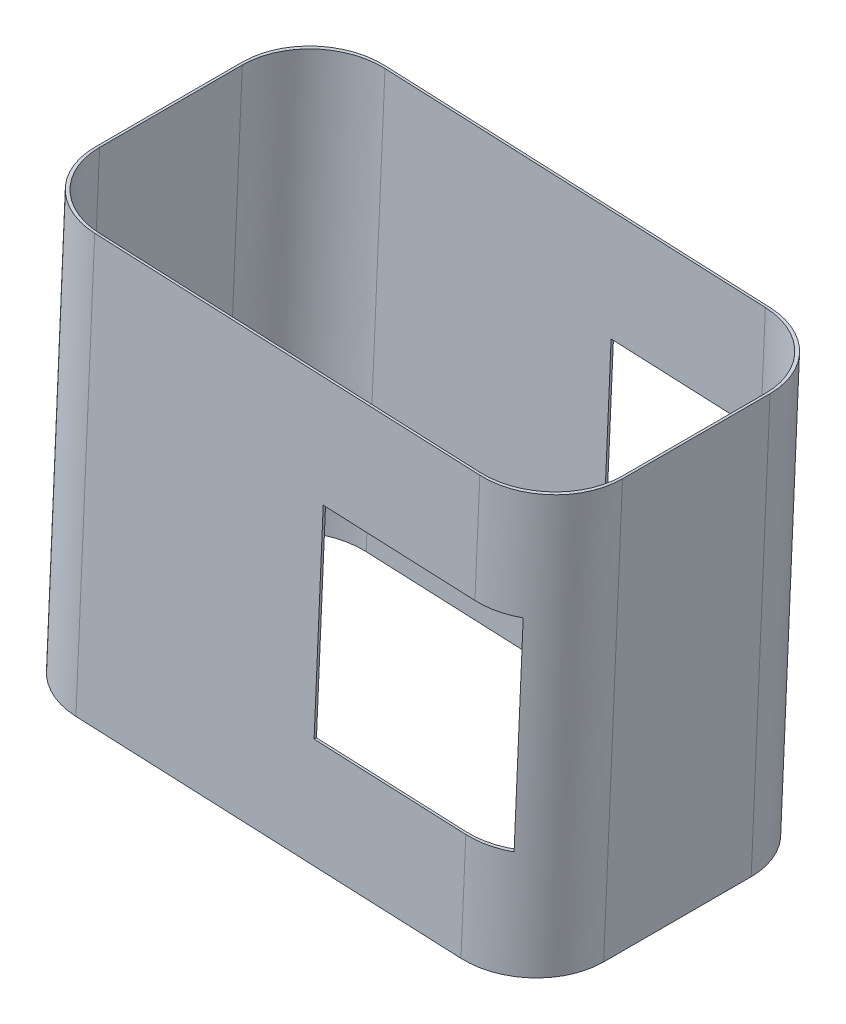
ISO-10303-21;
HEADER;
FILE_DESCRIPTION(('STEP AP214'),'2;1');
FILE_NAME('part.step','',(''),(''),'','','');
FILE_SCHEMA(('AUTOMOTIVE_DESIGN { 1 0 10303 214 1 1 1 1 }'));
ENDSEC;
DATA;
#1=APPLICATION_CONTEXT('core data for automotive mechanical design processes');
#2=APPLICATION_PROTOCOL_DEFINITION('international standard','automotive_design',2000,#1);
#3=PRODUCT_CONTEXT('',#1,'mechanical');
#4=PRODUCT('Part','Part','',(#3));
#5=PRODUCT_RELATED_PRODUCT_CATEGORY('part','',(#4));
#6=PRODUCT_DEFINITION_FORMATION('','',#4);
#7=PRODUCT_DEFINITION_CONTEXT('part definition',#1,'design');
#8=PRODUCT_DEFINITION('design','',#6,#7);
#9=PRODUCT_DEFINITION_SHAPE('','',#8);
#10=(LENGTH_UNIT() NAMED_UNIT(*) SI_UNIT(.MILLI.,.METRE.));
#11=(NAMED_UNIT(*) PLANE_ANGLE_UNIT() SI_UNIT($,.RADIAN.));
#12=(NAMED_UNIT(*) SI_UNIT($,.STERADIAN.) SOLID_ANGLE_UNIT());
#13=UNCERTAINTY_MEASURE_WITH_UNIT(LENGTH_MEASURE(1.E-05),#10,'distance_accuracy_value','');
#14=(GEOMETRIC_REPRESENTATION_CONTEXT(3) GLOBAL_UNCERTAINTY_ASSIGNED_CONTEXT((#13)) GLOBAL_UNIT_ASSIGNED_CONTEXT((#10,
#11,#12)) REPRESENTATION_CONTEXT('',''));
#15=CARTESIAN_POINT('',(0.,0.,0.));
#16=DIRECTION('',(0.,0.,1.));
#17=DIRECTION('',(1.,0.,0.));
#18=AXIS2_PLACEMENT_3D('',#15,#16,#17);
#19=CARTESIAN_POINT('',(-35.4159993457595,1.45818614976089,-39.2));
#20=DIRECTION('',(0.999030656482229,-0.0440198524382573,0.));
#21=DIRECTION('',(0.0440198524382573,0.999030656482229,0.));
#22=AXIS2_PLACEMENT_3D('',#19,#20,#21);
#23=PLANE('',#22);
#24=DIRECTION('',(0.0440198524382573,0.999030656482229,0.));
#25=VECTOR('',#24,1.);
#26=CARTESIAN_POINT('',(-35.223014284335,5.83798258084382,-27.4501272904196));
#27=LINE('',#26,#25);
#28=CARTESIAN_POINT('',(-35.0323227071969,10.1657283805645,-27.4501272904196));
#29=VERTEX_POINT('',#28);
#30=CARTESIAN_POINT('',(-35.4159993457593,1.45818614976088,-27.4501272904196));
#31=VERTEX_POINT('',#30);
#32=EDGE_CURVE('E219',#29,#31,#27,.F.);
#33=ORIENTED_EDGE('',*,*,#32,.F.);
#34=DIRECTION('',(0.,0.,1.));
#35=VECTOR('',#34,1.);
#36=CARTESIAN_POINT('',(-35.032322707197,10.1657283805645,-39.2));
#37=LINE('',#36,#35);
#38=CARTESIAN_POINT('',(-35.0323227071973,10.1657283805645,-27.6148963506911));
#39=VERTEX_POINT('',#38);
#40=EDGE_CURVE('E205',#39,#29,#37,.T.);
#41=ORIENTED_EDGE('',*,*,#40,.F.);
#42=DIRECTION('',(0.0440198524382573,0.999030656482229,0.));
#43=VECTOR('',#42,1.);
#44=CARTESIAN_POINT('',(-35.2230142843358,5.83798258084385,-27.6148963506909));
#45=LINE('',#44,#43);
#46=CARTESIAN_POINT('',(-35.4159993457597,1.45818614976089,-27.6148963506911));
#47=VERTEX_POINT('',#46);
#48=EDGE_CURVE('E230',#39,#47,#45,.F.);
#49=ORIENTED_EDGE('',*,*,#48,.T.);
#50=DIRECTION('',(0.,0.,1.));
#51=VECTOR('',#50,1.);
#52=CARTESIAN_POINT('',(-35.4159993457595,1.45818614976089,-39.2));
#53=LINE('',#52,#51);
#54=EDGE_CURVE('E223',#31,#47,#53,.F.);
#55=ORIENTED_EDGE('',*,*,#54,.F.);
#56=EDGE_LOOP('',(#33,#41,#49,#55));
#57=FACE_BOUND('',#56,.T.);
#58=ADVANCED_FACE('F17',(#57),#23,.F.);
#59=CARTESIAN_POINT('',(-42.9879842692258,10.5162752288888,-39.2));
#60=DIRECTION('',(-0.0440198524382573,-0.999030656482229,0.));
#61=DIRECTION('',(0.999030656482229,-0.0440198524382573,0.));
#62=AXIS2_PLACEMENT_3D('',#59,#60,#61);
#63=PLANE('',#62);
#64=DIRECTION('',(-0.999030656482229,0.0440198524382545,0.));
#65=VECTOR('',#64,1.);
#66=CARTESIAN_POINT('',(-36.6113440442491,10.2353041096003,-27.));
#67=LINE('',#66,#65);
#68=CARTESIAN_POINT('',(-36.6113440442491,10.2353041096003,-27.));
#69=VERTEX_POINT('',#68);
#70=CARTESIAN_POINT('',(-42.9879842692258,10.5162752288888,-27.));
#71=VERTEX_POINT('',#70);
#72=EDGE_CURVE('E199',#69,#71,#67,.T.);
#73=ORIENTED_EDGE('',*,*,#72,.T.);
#74=DIRECTION('',(0.,0.,1.));
#75=VECTOR('',#74,1.);
#76=CARTESIAN_POINT('',(-42.9879842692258,10.5162752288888,-39.2));
#77=LINE('',#76,#75);
#78=CARTESIAN_POINT('',(-42.9879842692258,10.5162752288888,-27.1));
#79=VERTEX_POINT('',#78);
#80=EDGE_CURVE('E214',#71,#79,#77,.F.);
#81=ORIENTED_EDGE('',*,*,#80,.T.);
#82=DIRECTION('',(-0.999030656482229,0.0440198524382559,0.));
#83=VECTOR('',#82,1.);
#84=CARTESIAN_POINT('',(-36.7112471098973,10.2397060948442,-27.1));
#85=LINE('',#84,#83);
#86=CARTESIAN_POINT('',(-36.7112471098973,10.2397060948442,-27.1));
#87=VERTEX_POINT('',#86);
#88=EDGE_CURVE('E353',#87,#79,#85,.T.);
#89=ORIENTED_EDGE('',*,*,#88,.F.);
#90=CARTESIAN_POINT('',(-36.7112471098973,10.2397060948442,-30.1));
#91=DIRECTION('',(0.0440198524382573,0.999030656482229,0.));
#92=DIRECTION('',(-0.999030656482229,0.0440198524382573,0.));
#93=AXIS2_PLACEMENT_3D('',#90,#91,#92);
#94=CIRCLE('',#93,3.);
#95=EDGE_CURVE('E209',#87,#39,#94,.T.);
#96=ORIENTED_EDGE('',*,*,#95,.T.);
#97=ORIENTED_EDGE('',*,*,#40,.T.);
#98=CARTESIAN_POINT('',(-36.6113440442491,10.2353041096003,-30.));
#99=DIRECTION('',(0.0440198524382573,0.999030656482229,0.));
#100=DIRECTION('',(-0.999030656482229,0.0440198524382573,0.));
#101=AXIS2_PLACEMENT_3D('',#98,#99,#100);
#102=CIRCLE('',#101,3.);
#103=EDGE_CURVE('E20',#69,#29,#102,.T.);
#104=ORIENTED_EDGE('',*,*,#103,.F.);
#105=EDGE_LOOP('',(#73,#81,#89,#96,#97,#104));
#106=FACE_BOUND('',#105,.T.);
#107=ADVANCED_FACE('F207',(#106),#63,.T.);
#108=CARTESIAN_POINT('',(-42.9879842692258,10.5162752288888,-39.2));
#109=DIRECTION('',(-0.999030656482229,0.0440198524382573,0.));
#110=DIRECTION('',(-0.0440198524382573,-0.999030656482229,0.));
#111=AXIS2_PLACEMENT_3D('',#108,#109,#110);
#112=PLANE('',#111);
#113=DIRECTION('',(-0.0440198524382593,-0.999030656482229,0.));
#114=VECTOR('',#113,1.);
#115=CARTESIAN_POINT('',(-42.9879842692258,10.5162752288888,-27.));
#116=LINE('',#115,#114);
#117=CARTESIAN_POINT('',(-43.3716609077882,1.80873299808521,-27.));
#118=VERTEX_POINT('',#117);
#119=EDGE_CURVE('E232',#71,#118,#116,.T.);
#120=ORIENTED_EDGE('',*,*,#119,.T.);
#121=DIRECTION('',(0.,0.,1.));
#122=VECTOR('',#121,1.);
#123=CARTESIAN_POINT('',(-43.3716609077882,1.80873299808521,-39.2));
#124=LINE('',#123,#122);
#125=CARTESIAN_POINT('',(-43.3716609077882,1.80873299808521,-27.1));
#126=VERTEX_POINT('',#125);
#127=EDGE_CURVE('E356',#126,#118,#124,.T.);
#128=ORIENTED_EDGE('',*,*,#127,.F.);
#129=DIRECTION('',(-0.0440198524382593,-0.999030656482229,0.));
#130=VECTOR('',#129,1.);
#131=CARTESIAN_POINT('',(-42.9879842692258,10.5162752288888,-27.1));
#132=LINE('',#131,#130);
#133=EDGE_CURVE('E361',#79,#126,#132,.T.);
#134=ORIENTED_EDGE('',*,*,#133,.F.);
#135=ORIENTED_EDGE('',*,*,#80,.F.);
#136=EDGE_LOOP('',(#120,#128,#134,#135));
#137=FACE_BOUND('',#136,.T.);
#138=ADVANCED_FACE('F383',(#137),#112,.F.);
#139=CARTESIAN_POINT('',(-35.4159993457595,1.45818614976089,-39.2));
#140=DIRECTION('',(0.0440198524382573,0.999030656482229,0.));
#141=DIRECTION('',(-0.999030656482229,0.0440198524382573,0.));
#142=AXIS2_PLACEMENT_3D('',#139,#140,#141);
#143=PLANE('',#142);
#144=CARTESIAN_POINT('',(-36.9950206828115,1.52776187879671,-30.));
#145=DIRECTION('',(0.0440198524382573,0.999030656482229,0.));
#146=DIRECTION('',(-0.999030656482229,0.0440198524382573,0.));
#147=AXIS2_PLACEMENT_3D('',#144,#145,#146);
#148=CIRCLE('',#147,3.);
#149=CARTESIAN_POINT('',(-36.9950206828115,1.52776187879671,-27.));
#150=VERTEX_POINT('',#149);
#151=EDGE_CURVE('E225',#31,#150,#148,.F.);
#152=ORIENTED_EDGE('',*,*,#151,.F.);
#153=ORIENTED_EDGE('',*,*,#54,.T.);
#154=CARTESIAN_POINT('',(-37.0949237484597,1.53216386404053,-30.1));
#155=DIRECTION('',(0.0440198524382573,0.999030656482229,0.));
#156=DIRECTION('',(-0.999030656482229,0.0440198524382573,0.));
#157=AXIS2_PLACEMENT_3D('',#154,#155,#156);
#158=CIRCLE('',#157,3.);
#159=CARTESIAN_POINT('',(-37.0949237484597,1.53216386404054,-27.1));
#160=VERTEX_POINT('',#159);
#161=EDGE_CURVE('E318',#47,#160,#158,.F.);
#162=ORIENTED_EDGE('',*,*,#161,.T.);
#163=DIRECTION('',(0.999030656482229,-0.0440198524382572,0.));
#164=VECTOR('',#163,1.);
#165=CARTESIAN_POINT('',(-43.3716609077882,1.80873299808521,-27.1));
#166=LINE('',#165,#164);
#167=EDGE_CURVE('E357',#126,#160,#166,.T.);
#168=ORIENTED_EDGE('',*,*,#167,.F.);
#169=ORIENTED_EDGE('',*,*,#127,.T.);
#170=DIRECTION('',(0.999030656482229,-0.0440198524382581,0.));
#171=VECTOR('',#170,1.);
#172=CARTESIAN_POINT('',(-43.3716609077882,1.80873299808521,-27.));
#173=LINE('',#172,#171);
#174=EDGE_CURVE('E236',#118,#150,#173,.T.);
#175=ORIENTED_EDGE('',*,*,#174,.T.);
#176=EDGE_LOOP('',(#152,#153,#162,#168,#169,#175));
#177=FACE_BOUND('',#176,.T.);
#178=ADVANCED_FACE('F387',(#177),#143,.T.);
#179=CARTESIAN_POINT('',(-55.9834242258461,6.7527394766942,-27.));
#180=DIRECTION('',(0.999030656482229,-0.0440198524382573,0.));
#181=DIRECTION('',(0.0440198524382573,0.999030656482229,0.));
#182=AXIS2_PLACEMENT_3D('',#179,#180,#181);
#183=PLANE('',#182);
#184=DIRECTION('',(0.,0.,1.));
#185=VECTOR('',#184,1.);
#186=CARTESIAN_POINT('',(-56.3796028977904,-2.23853643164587,-33.1));
#187=LINE('',#186,#185);
#188=CARTESIAN_POINT('',(-56.3796028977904,-2.23853643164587,-36.2));
#189=VERTEX_POINT('',#188);
#190=CARTESIAN_POINT('',(-56.3796028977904,-2.23853643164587,-30.));
#191=VERTEX_POINT('',#190);
#192=EDGE_CURVE('E294',#189,#191,#187,.T.);
#193=ORIENTED_EDGE('',*,*,#192,.T.);
#194=DIRECTION('',(0.0440198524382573,0.999030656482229,0.));
#195=VECTOR('',#194,1.);
#196=CARTESIAN_POINT('',(-55.9834242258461,6.7527394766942,-30.));
#197=LINE('',#196,#195);
#198=CARTESIAN_POINT('',(-55.5872455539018,15.7440153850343,-30.));
#199=VERTEX_POINT('',#198);
#200=EDGE_CURVE('E348',#199,#191,#197,.F.);
#201=ORIENTED_EDGE('',*,*,#200,.F.);
#202=DIRECTION('',(0.,0.,1.));
#203=VECTOR('',#202,1.);
#204=CARTESIAN_POINT('',(-55.5872455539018,15.7440153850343,-33.1));
#205=LINE('',#204,#203);
#206=CARTESIAN_POINT('',(-55.5872455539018,15.7440153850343,-36.2));
#207=VERTEX_POINT('',#206);
#208=EDGE_CURVE('E317',#207,#199,#205,.T.);
#209=ORIENTED_EDGE('',*,*,#208,.F.);
#210=DIRECTION('',(0.0440198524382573,0.999030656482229,0.));
#211=VECTOR('',#210,1.);
#212=CARTESIAN_POINT('',(-55.9834242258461,6.7527394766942,-36.2));
#213=LINE('',#212,#211);
#214=EDGE_CURVE('E297',#189,#207,#213,.T.);
#215=ORIENTED_EDGE('',*,*,#214,.F.);
#216=EDGE_LOOP('',(#193,#201,#209,#215));
#217=FACE_BOUND('',#216,.T.);
#218=ADVANCED_FACE('F546',(#217),#183,.F.);
#219=CARTESIAN_POINT('',(-52.9863322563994,6.62067991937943,-30.));
#220=DIRECTION('',(0.0440198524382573,0.999030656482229,0.));
#221=DIRECTION('',(-0.999030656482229,0.0440198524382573,0.));
#222=AXIS2_PLACEMENT_3D('',#219,#220,#221);
#223=CYLINDRICAL_SURFACE('',#222,3.);
#224=CARTESIAN_POINT('',(-53.3825109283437,-2.37059598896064,-30.));
#225=DIRECTION('',(0.0440198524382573,0.999030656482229,0.));
#226=DIRECTION('',(-0.999030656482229,0.0440198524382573,0.));
#227=AXIS2_PLACEMENT_3D('',#224,#225,#226);
#228=CIRCLE('',#227,3.);
#229=CARTESIAN_POINT('',(-53.3825109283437,-2.37059598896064,-27.));
#230=VERTEX_POINT('',#229);
#231=EDGE_CURVE('E291',#191,#230,#228,.T.);
#232=ORIENTED_EDGE('',*,*,#231,.T.);
#233=DIRECTION('',(0.0440198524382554,0.999030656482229,0.));
#234=VECTOR('',#233,1.);
#235=CARTESIAN_POINT('',(-53.3825109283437,-2.37059598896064,-27.));
#236=LINE('',#235,#234);
#237=CARTESIAN_POINT('',(-52.5901535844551,15.6119558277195,-27.));
#238=VERTEX_POINT('',#237);
#239=EDGE_CURVE('E233',#230,#238,#236,.T.);
#240=ORIENTED_EDGE('',*,*,#239,.T.);
#241=CARTESIAN_POINT('',(-52.5901535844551,15.6119558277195,-30.));
#242=DIRECTION('',(0.0440198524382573,0.999030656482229,0.));
#243=DIRECTION('',(-0.999030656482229,0.0440198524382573,0.));
#244=AXIS2_PLACEMENT_3D('',#241,#242,#243);
#245=CIRCLE('',#244,3.);
#246=EDGE_CURVE('E315',#199,#238,#245,.T.);
#247=ORIENTED_EDGE('',*,*,#246,.F.);
#248=ORIENTED_EDGE('',*,*,#200,.T.);
#249=EDGE_LOOP('',(#232,#240,#247,#248));
#250=FACE_BOUND('',#249,.T.);
#251=ADVANCED_FACE('F542',(#250),#223,.T.);
#252=CARTESIAN_POINT('',(-33.8049436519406,5.77549875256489,-27.));
#253=DIRECTION('',(0.,0.,-1.));
#254=DIRECTION('',(-1.,0.,0.));
#255=AXIS2_PLACEMENT_3D('',#252,#253,#254);
#256=PLANE('',#255);
#257=ORIENTED_EDGE('',*,*,#119,.F.);
#258=ORIENTED_EDGE('',*,*,#72,.F.);
#259=DIRECTION('',(0.0440198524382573,0.999030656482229,0.));
#260=VECTOR('',#259,1.);
#261=CARTESIAN_POINT('',(-36.8020356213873,5.90755830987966,-27.));
#262=LINE('',#261,#260);
#263=CARTESIAN_POINT('',(-36.405856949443,14.8988342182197,-27.));
#264=VERTEX_POINT('',#263);
#265=EDGE_CURVE('E222',#264,#69,#262,.F.);
#266=ORIENTED_EDGE('',*,*,#265,.F.);
#267=DIRECTION('',(-0.999030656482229,0.0440198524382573,0.));
#268=VECTOR('',#267,1.);
#269=CARTESIAN_POINT('',(-44.4980052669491,15.2553950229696,-27.));
#270=LINE('',#269,#268);
#271=EDGE_CURVE('E314',#238,#264,#270,.F.);
#272=ORIENTED_EDGE('',*,*,#271,.F.);
#273=ORIENTED_EDGE('',*,*,#239,.F.);
#274=DIRECTION('',(-0.999030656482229,0.0440198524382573,0.));
#275=VECTOR('',#274,1.);
#276=CARTESIAN_POINT('',(-45.2903626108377,-2.72715679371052,-27.));
#277=LINE('',#276,#275);
#278=CARTESIAN_POINT('',(-37.1982142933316,-3.08371759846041,-27.));
#279=VERTEX_POINT('',#278);
#280=EDGE_CURVE('E290',#230,#279,#277,.F.);
#281=ORIENTED_EDGE('',*,*,#280,.T.);
#282=DIRECTION('',(0.0440198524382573,0.999030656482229,0.));
#283=VECTOR('',#282,1.);
#284=CARTESIAN_POINT('',(-36.8020356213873,5.90755830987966,-27.));
#285=LINE('',#284,#283);
#286=EDGE_CURVE('E238',#150,#279,#285,.F.);
#287=ORIENTED_EDGE('',*,*,#286,.F.);
#288=ORIENTED_EDGE('',*,*,#174,.F.);
#289=EDGE_LOOP('',(#257,#258,#266,#272,#273,#281,#287,#288));
#290=FACE_BOUND('',#289,.T.);
#291=ADVANCED_FACE('F539',(#290),#256,.F.);
#292=CARTESIAN_POINT('',(-36.8020356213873,5.90755830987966,-30.));
#293=DIRECTION('',(0.0440198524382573,0.999030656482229,0.));
#294=DIRECTION('',(-0.999030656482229,0.0440198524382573,0.));
#295=AXIS2_PLACEMENT_3D('',#292,#293,#294);
#296=CYLINDRICAL_SURFACE('',#295,3.);
#297=ORIENTED_EDGE('',*,*,#32,.T.);
#298=ORIENTED_EDGE('',*,*,#151,.T.);
#299=ORIENTED_EDGE('',*,*,#286,.T.);
#300=CARTESIAN_POINT('',(-37.1982142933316,-3.08371759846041,-30.));
#301=DIRECTION('',(0.0440198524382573,0.999030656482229,0.));
#302=DIRECTION('',(-0.999030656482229,0.0440198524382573,0.));
#303=AXIS2_PLACEMENT_3D('',#300,#301,#302);
#304=CIRCLE('',#303,3.);
#305=CARTESIAN_POINT('',(-34.2011223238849,-3.21577715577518,-30.));
#306=VERTEX_POINT('',#305);
#307=EDGE_CURVE('E287',#279,#306,#304,.T.);
#308=ORIENTED_EDGE('',*,*,#307,.T.);
#309=DIRECTION('',(-0.0440198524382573,-0.999030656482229,0.));
#310=VECTOR('',#309,1.);
#311=CARTESIAN_POINT('',(-33.8049436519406,5.77549875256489,-30.));
#312=LINE('',#311,#310);
#313=CARTESIAN_POINT('',(-33.4087649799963,14.7667746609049,-30.));
#314=VERTEX_POINT('',#313);
#315=EDGE_CURVE('E340',#306,#314,#312,.F.);
#316=ORIENTED_EDGE('',*,*,#315,.T.);
#317=CARTESIAN_POINT('',(-36.405856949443,14.8988342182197,-30.));
#318=DIRECTION('',(0.0440198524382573,0.999030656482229,0.));
#319=DIRECTION('',(-0.999030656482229,0.0440198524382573,0.));
#320=AXIS2_PLACEMENT_3D('',#317,#318,#319);
#321=CIRCLE('',#320,3.);
#322=EDGE_CURVE('E312',#264,#314,#321,.T.);
#323=ORIENTED_EDGE('',*,*,#322,.F.);
#324=ORIENTED_EDGE('',*,*,#265,.T.);
#325=ORIENTED_EDGE('',*,*,#103,.T.);
#326=EDGE_LOOP('',(#297,#298,#299,#308,#316,#323,#324,#325));
#327=FACE_BOUND('',#326,.T.);
#328=ADVANCED_FACE('F217',(#327),#296,.T.);
#329=CARTESIAN_POINT('',(-52.8864291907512,6.6162779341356,-36.1));
#330=DIRECTION('',(0.0440198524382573,0.999030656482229,0.));
#331=DIRECTION('',(-0.999030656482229,0.0440198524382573,0.));
#332=AXIS2_PLACEMENT_3D('',#329,#330,#331);
#333=CYLINDRICAL_SURFACE('',#332,3.);
#334=CARTESIAN_POINT('',(-52.4902505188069,15.6075538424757,-36.1));
#335=DIRECTION('',(0.0440198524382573,0.999030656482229,0.));
#336=DIRECTION('',(-0.999030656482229,0.0440198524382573,0.));
#337=AXIS2_PLACEMENT_3D('',#334,#335,#336);
#338=CIRCLE('',#337,3.);
#339=CARTESIAN_POINT('',(-55.4873424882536,15.7396133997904,-36.1));
#340=VERTEX_POINT('',#339);
#341=CARTESIAN_POINT('',(-52.4902505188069,15.6075538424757,-39.1));
#342=VERTEX_POINT('',#341);
#343=EDGE_CURVE('E309',#340,#342,#338,.F.);
#344=ORIENTED_EDGE('',*,*,#343,.F.);
#345=DIRECTION('',(0.0440198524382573,0.999030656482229,0.));
#346=VECTOR('',#345,1.);
#347=CARTESIAN_POINT('',(-55.8835211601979,6.74833749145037,-36.1));
#348=LINE('',#347,#346);
#349=CARTESIAN_POINT('',(-56.2796998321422,-2.2429384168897,-36.1));
#350=VERTEX_POINT('',#349);
#351=EDGE_CURVE('E344',#350,#340,#348,.T.);
#352=ORIENTED_EDGE('',*,*,#351,.F.);
#353=CARTESIAN_POINT('',(-53.2826078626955,-2.37499797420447,-36.1));
#354=DIRECTION('',(0.0440198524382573,0.999030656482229,0.));
#355=DIRECTION('',(-0.999030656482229,0.0440198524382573,0.));
#356=AXIS2_PLACEMENT_3D('',#353,#354,#355);
#357=CIRCLE('',#356,3.);
#358=CARTESIAN_POINT('',(-53.2826078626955,-2.37499797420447,-39.1));
#359=VERTEX_POINT('',#358);
#360=EDGE_CURVE('E280',#350,#359,#357,.F.);
#361=ORIENTED_EDGE('',*,*,#360,.T.);
#362=DIRECTION('',(-0.0440198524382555,-0.999030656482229,0.));
#363=VECTOR('',#362,1.);
#364=CARTESIAN_POINT('',(-52.4902505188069,15.6075538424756,-39.1));
#365=LINE('',#364,#363);
#366=EDGE_CURVE('E334',#342,#359,#365,.T.);
#367=ORIENTED_EDGE('',*,*,#366,.F.);
#368=EDGE_LOOP('',(#344,#352,#361,#367));
#369=FACE_BOUND('',#368,.T.);
#370=ADVANCED_FACE('F470',(#369),#333,.F.);
#371=CARTESIAN_POINT('',(-33.9048467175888,5.77990073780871,-39.1));
#372=DIRECTION('',(-0.999030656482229,0.0440198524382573,0.));
#373=DIRECTION('',(-0.0440198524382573,-0.999030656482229,0.));
#374=AXIS2_PLACEMENT_3D('',#371,#372,#373);
#375=PLANE('',#374);
#376=DIRECTION('',(0.,0.,1.));
#377=VECTOR('',#376,1.);
#378=CARTESIAN_POINT('',(-33.5086680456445,14.7711766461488,-33.1));
#379=LINE('',#378,#377);
#380=CARTESIAN_POINT('',(-33.5086680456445,14.7711766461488,-36.1));
#381=VERTEX_POINT('',#380);
#382=CARTESIAN_POINT('',(-33.5086680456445,14.7711766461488,-30.1));
#383=VERTEX_POINT('',#382);
#384=EDGE_CURVE('E304',#381,#383,#379,.T.);
#385=ORIENTED_EDGE('',*,*,#384,.F.);
#386=DIRECTION('',(0.0440198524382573,0.999030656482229,0.));
#387=VECTOR('',#386,1.);
#388=CARTESIAN_POINT('',(-33.9048467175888,5.77990073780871,-36.1));
#389=LINE('',#388,#387);
#390=CARTESIAN_POINT('',(-34.3010253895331,-3.21137517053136,-36.1));
#391=VERTEX_POINT('',#390);
#392=EDGE_CURVE('E330',#381,#391,#389,.F.);
#393=ORIENTED_EDGE('',*,*,#392,.T.);
#394=DIRECTION('',(0.,0.,1.));
#395=VECTOR('',#394,1.);
#396=CARTESIAN_POINT('',(-34.3010253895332,-3.21137517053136,-33.1));
#397=LINE('',#396,#395);
#398=CARTESIAN_POINT('',(-34.3010253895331,-3.21137517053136,-30.1));
#399=VERTEX_POINT('',#398);
#400=EDGE_CURVE('E275',#391,#399,#397,.T.);
#401=ORIENTED_EDGE('',*,*,#400,.T.);
#402=DIRECTION('',(0.0440198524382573,0.999030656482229,0.));
#403=VECTOR('',#402,1.);
#404=CARTESIAN_POINT('',(-33.9048467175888,5.77990073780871,-30.1));
#405=LINE('',#404,#403);
#406=EDGE_CURVE('E227',#399,#383,#405,.T.);
#407=ORIENTED_EDGE('',*,*,#406,.T.);
#408=EDGE_LOOP('',(#385,#393,#401,#407));
#409=FACE_BOUND('',#408,.T.);
#410=ADVANCED_FACE('F401',(#409),#375,.T.);
#411=CARTESIAN_POINT('',(-36.9019386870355,5.91196029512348,-30.1));
#412=DIRECTION('',(0.0440198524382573,0.999030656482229,0.));
#413=DIRECTION('',(-0.999030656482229,0.0440198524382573,0.));
#414=AXIS2_PLACEMENT_3D('',#411,#412,#413);
#415=CYLINDRICAL_SURFACE('',#414,3.);
#416=ORIENTED_EDGE('',*,*,#48,.F.);
#417=ORIENTED_EDGE('',*,*,#95,.F.);
#418=DIRECTION('',(-0.0440198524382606,-0.999030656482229,0.));
#419=VECTOR('',#418,1.);
#420=CARTESIAN_POINT('',(-36.5057600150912,14.9032362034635,-27.1));
#421=LINE('',#420,#419);
#422=CARTESIAN_POINT('',(-36.5057600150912,14.9032362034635,-27.1));
#423=VERTEX_POINT('',#422);
#424=EDGE_CURVE('E350',#423,#87,#421,.T.);
#425=ORIENTED_EDGE('',*,*,#424,.F.);
#426=CARTESIAN_POINT('',(-36.5057600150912,14.9032362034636,-30.1));
#427=DIRECTION('',(0.0440198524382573,0.999030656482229,0.));
#428=DIRECTION('',(-0.999030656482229,0.0440198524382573,0.));
#429=AXIS2_PLACEMENT_3D('',#426,#427,#428);
#430=CIRCLE('',#429,3.);
#431=EDGE_CURVE('E302',#383,#423,#430,.F.);
#432=ORIENTED_EDGE('',*,*,#431,.F.);
#433=ORIENTED_EDGE('',*,*,#406,.F.);
#434=CARTESIAN_POINT('',(-37.2981173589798,-3.07931561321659,-30.1));
#435=DIRECTION('',(0.0440198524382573,0.999030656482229,0.));
#436=DIRECTION('',(-0.999030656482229,0.0440198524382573,0.));
#437=AXIS2_PLACEMENT_3D('',#434,#435,#436);
#438=CIRCLE('',#437,3.);
#439=CARTESIAN_POINT('',(-37.2981173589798,-3.07931561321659,-27.1));
#440=VERTEX_POINT('',#439);
#441=EDGE_CURVE('E272',#399,#440,#438,.F.);
#442=ORIENTED_EDGE('',*,*,#441,.T.);
#443=DIRECTION('',(-0.0440198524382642,-0.999030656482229,0.));
#444=VECTOR('',#443,1.);
#445=CARTESIAN_POINT('',(-37.0949237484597,1.53216386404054,-27.1));
#446=LINE('',#445,#444);
#447=EDGE_CURVE('E320',#160,#440,#446,.T.);
#448=ORIENTED_EDGE('',*,*,#447,.F.);
#449=ORIENTED_EDGE('',*,*,#161,.F.);
#450=EDGE_LOOP('',(#416,#417,#425,#432,#433,#442,#448,#449));
#451=FACE_BOUND('',#450,.T.);
#452=ADVANCED_FACE('F393',(#451),#415,.F.);
#453=CARTESIAN_POINT('',(-33.9048467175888,5.77990073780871,-27.1));
#454=DIRECTION('',(0.,0.,-1.));
#455=DIRECTION('',(-1.,0.,0.));
#456=AXIS2_PLACEMENT_3D('',#453,#454,#455);
#457=PLANE('',#456);
#458=ORIENTED_EDGE('',*,*,#133,.T.);
#459=ORIENTED_EDGE('',*,*,#167,.T.);
#460=ORIENTED_EDGE('',*,*,#447,.T.);
#461=DIRECTION('',(-0.999030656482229,0.0440198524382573,0.));
#462=VECTOR('',#461,1.);
#463=CARTESIAN_POINT('',(-45.2903626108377,-2.72715679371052,-27.1));
#464=LINE('',#463,#462);
#465=CARTESIAN_POINT('',(-53.2826078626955,-2.37499797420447,-27.1));
#466=VERTEX_POINT('',#465);
#467=EDGE_CURVE('E271',#440,#466,#464,.T.);
#468=ORIENTED_EDGE('',*,*,#467,.T.);
#469=DIRECTION('',(0.0440198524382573,0.999030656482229,0.));
#470=VECTOR('',#469,1.);
#471=CARTESIAN_POINT('',(-52.8864291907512,6.6162779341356,-27.1));
#472=LINE('',#471,#470);
#473=CARTESIAN_POINT('',(-52.4902505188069,15.6075538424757,-27.1));
#474=VERTEX_POINT('',#473);
#475=EDGE_CURVE('E360',#466,#474,#472,.T.);
#476=ORIENTED_EDGE('',*,*,#475,.T.);
#477=DIRECTION('',(-0.999030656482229,0.0440198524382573,0.));
#478=VECTOR('',#477,1.);
#479=CARTESIAN_POINT('',(-44.4980052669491,15.2553950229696,-27.1));
#480=LINE('',#479,#478);
#481=EDGE_CURVE('E301',#423,#474,#480,.T.);
#482=ORIENTED_EDGE('',*,*,#481,.F.);
#483=ORIENTED_EDGE('',*,*,#424,.T.);
#484=ORIENTED_EDGE('',*,*,#88,.T.);
#485=EDGE_LOOP('',(#458,#459,#460,#468,#476,#482,#483,#484));
#486=FACE_BOUND('',#485,.T.);
#487=ADVANCED_FACE('F377',(#486),#457,.T.);
#488=CARTESIAN_POINT('',(-52.8864291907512,6.6162779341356,-30.1));
#489=DIRECTION('',(0.0440198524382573,0.999030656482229,0.));
#490=DIRECTION('',(-0.999030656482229,0.0440198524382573,0.));
#491=AXIS2_PLACEMENT_3D('',#488,#489,#490);
#492=CYLINDRICAL_SURFACE('',#491,3.);
#493=CARTESIAN_POINT('',(-52.4902505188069,15.6075538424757,-30.1));
#494=DIRECTION('',(0.0440198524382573,0.999030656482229,0.));
#495=DIRECTION('',(-0.999030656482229,0.0440198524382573,0.));
#496=AXIS2_PLACEMENT_3D('',#493,#494,#495);
#497=CIRCLE('',#496,3.);
#498=CARTESIAN_POINT('',(-55.4873424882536,15.7396133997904,-30.1));
#499=VERTEX_POINT('',#498);
#500=EDGE_CURVE('E299',#474,#499,#497,.F.);
#501=ORIENTED_EDGE('',*,*,#500,.F.);
#502=ORIENTED_EDGE('',*,*,#475,.F.);
#503=CARTESIAN_POINT('',(-53.2826078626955,-2.37499797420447,-30.1));
#504=DIRECTION('',(0.0440198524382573,0.999030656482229,0.));
#505=DIRECTION('',(-0.999030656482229,0.0440198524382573,0.));
#506=AXIS2_PLACEMENT_3D('',#503,#504,#505);
#507=CIRCLE('',#506,3.);
#508=CARTESIAN_POINT('',(-56.2796998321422,-2.2429384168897,-30.1));
#509=VERTEX_POINT('',#508);
#510=EDGE_CURVE('E268',#466,#509,#507,.F.);
#511=ORIENTED_EDGE('',*,*,#510,.T.);
#512=DIRECTION('',(0.0440198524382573,0.999030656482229,0.));
#513=VECTOR('',#512,1.);
#514=CARTESIAN_POINT('',(-55.8835211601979,6.74833749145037,-30.1));
#515=LINE('',#514,#513);
#516=EDGE_CURVE('E443',#499,#509,#515,.F.);
#517=ORIENTED_EDGE('',*,*,#516,.F.);
#518=EDGE_LOOP('',(#501,#502,#511,#517));
#519=FACE_BOUND('',#518,.T.);
#520=ADVANCED_FACE('F449',(#519),#492,.F.);
#521=CARTESIAN_POINT('',(-55.8835211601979,6.74833749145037,-27.1));
#522=DIRECTION('',(0.999030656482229,-0.0440198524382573,0.));
#523=DIRECTION('',(0.0440198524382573,0.999030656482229,0.));
#524=AXIS2_PLACEMENT_3D('',#521,#522,#523);
#525=PLANE('',#524);
#526=DIRECTION('',(0.,0.,1.));
#527=VECTOR('',#526,1.);
#528=CARTESIAN_POINT('',(-56.2796998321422,-2.2429384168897,-33.1));
#529=LINE('',#528,#527);
#530=EDGE_CURVE('E267',#509,#350,#529,.F.);
#531=ORIENTED_EDGE('',*,*,#530,.T.);
#532=ORIENTED_EDGE('',*,*,#351,.T.);
#533=DIRECTION('',(0.,0.,1.));
#534=VECTOR('',#533,1.);
#535=CARTESIAN_POINT('',(-55.4873424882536,15.7396133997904,-33.1));
#536=LINE('',#535,#534);
#537=EDGE_CURVE('E298',#499,#340,#536,.F.);
#538=ORIENTED_EDGE('',*,*,#537,.F.);
#539=ORIENTED_EDGE('',*,*,#516,.T.);
#540=EDGE_LOOP('',(#531,#532,#538,#539));
#541=FACE_BOUND('',#540,.T.);
#542=ADVANCED_FACE('F585',(#541),#525,.T.);
#543=CARTESIAN_POINT('',(-33.8049436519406,5.77549875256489,-39.2));
#544=DIRECTION('',(-0.999030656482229,0.0440198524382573,0.));
#545=DIRECTION('',(-0.0440198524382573,-0.999030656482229,0.));
#546=AXIS2_PLACEMENT_3D('',#543,#544,#545);
#547=PLANE('',#546);
#548=DIRECTION('',(0.,0.,1.));
#549=VECTOR('',#548,1.);
#550=CARTESIAN_POINT('',(-33.4087649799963,14.7667746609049,-33.1));
#551=LINE('',#550,#549);
#552=CARTESIAN_POINT('',(-33.4087649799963,14.766774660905,-36.2));
#553=VERTEX_POINT('',#552);
#554=EDGE_CURVE('E311',#314,#553,#551,.F.);
#555=ORIENTED_EDGE('',*,*,#554,.F.);
#556=ORIENTED_EDGE('',*,*,#315,.F.);
#557=DIRECTION('',(0.,0.,1.));
#558=VECTOR('',#557,1.);
#559=CARTESIAN_POINT('',(-34.2011223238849,-3.21577715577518,-33.1));
#560=LINE('',#559,#558);
#561=CARTESIAN_POINT('',(-34.2011223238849,-3.21577715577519,-36.2));
#562=VERTEX_POINT('',#561);
#563=EDGE_CURVE('E286',#306,#562,#560,.F.);
#564=ORIENTED_EDGE('',*,*,#563,.T.);
#565=DIRECTION('',(0.0440198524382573,0.999030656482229,0.));
#566=VECTOR('',#565,1.);
#567=CARTESIAN_POINT('',(-33.8049436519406,5.77549875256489,-36.2));
#568=LINE('',#567,#566);
#569=EDGE_CURVE('E263',#553,#562,#568,.F.);
#570=ORIENTED_EDGE('',*,*,#569,.F.);
#571=EDGE_LOOP('',(#555,#556,#564,#570));
#572=FACE_BOUND('',#571,.T.);
#573=ADVANCED_FACE('F535',(#572),#547,.F.);
#574=CARTESIAN_POINT('',(-35.4159993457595,1.45818614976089,-39.2));
#575=DIRECTION('',(0.999030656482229,-0.0440198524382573,0.));
#576=DIRECTION('',(0.0440198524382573,0.999030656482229,0.));
#577=AXIS2_PLACEMENT_3D('',#574,#575,#576);
#578=PLANE('',#577);
#579=DIRECTION('',(0.0440198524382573,0.999030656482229,0.));
#580=VECTOR('',#579,1.);
#581=CARTESIAN_POINT('',(-35.223014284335,5.83798258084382,-38.7498727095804));
#582=LINE('',#581,#580);
#583=CARTESIAN_POINT('',(-35.4159993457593,1.45818614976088,-38.7498727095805));
#584=VERTEX_POINT('',#583);
#585=CARTESIAN_POINT('',(-35.032322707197,10.1657283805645,-38.7498727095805));
#586=VERTEX_POINT('',#585);
#587=EDGE_CURVE('E262',#584,#586,#582,.T.);
#588=ORIENTED_EDGE('',*,*,#587,.F.);
#589=DIRECTION('',(0.,0.,1.));
#590=VECTOR('',#589,1.);
#591=CARTESIAN_POINT('',(-35.4159993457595,1.45818614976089,-39.2));
#592=LINE('',#591,#590);
#593=CARTESIAN_POINT('',(-35.4159993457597,1.4581861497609,-38.5851036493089));
#594=VERTEX_POINT('',#593);
#595=EDGE_CURVE('E343',#594,#584,#592,.F.);
#596=ORIENTED_EDGE('',*,*,#595,.F.);
#597=DIRECTION('',(0.0440198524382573,0.999030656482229,0.));
#598=VECTOR('',#597,1.);
#599=CARTESIAN_POINT('',(-35.2230142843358,5.83798258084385,-38.5851036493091));
#600=LINE('',#599,#598);
#601=CARTESIAN_POINT('',(-35.0323227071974,10.1657283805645,-38.5851036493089));
#602=VERTEX_POINT('',#601);
#603=EDGE_CURVE('E332',#594,#602,#600,.T.);
#604=ORIENTED_EDGE('',*,*,#603,.T.);
#605=DIRECTION('',(0.,0.,1.));
#606=VECTOR('',#605,1.);
#607=CARTESIAN_POINT('',(-35.0323227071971,10.1657283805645,-39.2));
#608=LINE('',#607,#606);
#609=EDGE_CURVE('E333',#586,#602,#608,.T.);
#610=ORIENTED_EDGE('',*,*,#609,.F.);
#611=EDGE_LOOP('',(#588,#596,#604,#610));
#612=FACE_BOUND('',#611,.T.);
#613=ADVANCED_FACE('F579',(#612),#578,.F.);
#614=CARTESIAN_POINT('',(-36.9019386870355,5.91196029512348,-36.1));
#615=DIRECTION('',(0.0440198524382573,0.999030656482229,0.));
#616=DIRECTION('',(-0.999030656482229,0.0440198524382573,0.));
#617=AXIS2_PLACEMENT_3D('',#614,#615,#616);
#618=CYLINDRICAL_SURFACE('',#617,3.);
#619=ORIENTED_EDGE('',*,*,#603,.F.);
#620=CARTESIAN_POINT('',(-37.0949237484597,1.53216386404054,-36.1));
#621=DIRECTION('',(0.0440198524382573,0.999030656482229,0.));
#622=DIRECTION('',(-0.999030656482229,0.0440198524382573,0.));
#623=AXIS2_PLACEMENT_3D('',#620,#621,#622);
#624=CIRCLE('',#623,3.);
#625=CARTESIAN_POINT('',(-37.0949237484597,1.53216386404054,-39.1));
#626=VERTEX_POINT('',#625);
#627=EDGE_CURVE('E256',#626,#594,#624,.F.);
#628=ORIENTED_EDGE('',*,*,#627,.F.);
#629=DIRECTION('',(0.0440198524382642,0.999030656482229,0.));
#630=VECTOR('',#629,1.);
#631=CARTESIAN_POINT('',(-37.2981173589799,-3.07931561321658,-39.1));
#632=LINE('',#631,#630);
#633=CARTESIAN_POINT('',(-37.2981173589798,-3.07931561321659,-39.1));
#634=VERTEX_POINT('',#633);
#635=EDGE_CURVE('E336',#634,#626,#632,.T.);
#636=ORIENTED_EDGE('',*,*,#635,.F.);
#637=CARTESIAN_POINT('',(-37.2981173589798,-3.07931561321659,-36.1));
#638=DIRECTION('',(0.0440198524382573,0.999030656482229,0.));
#639=DIRECTION('',(-0.999030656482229,0.0440198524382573,0.));
#640=AXIS2_PLACEMENT_3D('',#637,#638,#639);
#641=CIRCLE('',#640,3.);
#642=EDGE_CURVE('E276',#634,#391,#641,.F.);
#643=ORIENTED_EDGE('',*,*,#642,.T.);
#644=ORIENTED_EDGE('',*,*,#392,.F.);
#645=CARTESIAN_POINT('',(-36.5057600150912,14.9032362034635,-36.1));
#646=DIRECTION('',(0.0440198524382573,0.999030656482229,0.));
#647=DIRECTION('',(-0.999030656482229,0.0440198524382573,0.));
#648=AXIS2_PLACEMENT_3D('',#645,#646,#647);
#649=CIRCLE('',#648,3.);
#650=CARTESIAN_POINT('',(-36.5057600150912,14.9032362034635,-39.1));
#651=VERTEX_POINT('',#650);
#652=EDGE_CURVE('E305',#651,#381,#649,.F.);
#653=ORIENTED_EDGE('',*,*,#652,.F.);
#654=DIRECTION('',(0.0440198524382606,0.999030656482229,0.));
#655=VECTOR('',#654,1.);
#656=CARTESIAN_POINT('',(-36.7112471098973,10.2397060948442,-39.1));
#657=LINE('',#656,#655);
#658=CARTESIAN_POINT('',(-36.7112471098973,10.2397060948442,-39.1));
#659=VERTEX_POINT('',#658);
#660=EDGE_CURVE('E337',#659,#651,#657,.T.);
#661=ORIENTED_EDGE('',*,*,#660,.F.);
#662=CARTESIAN_POINT('',(-36.7112471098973,10.2397060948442,-36.1));
#663=DIRECTION('',(0.0440198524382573,0.999030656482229,0.));
#664=DIRECTION('',(-0.999030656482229,0.0440198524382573,0.));
#665=AXIS2_PLACEMENT_3D('',#662,#663,#664);
#666=CIRCLE('',#665,3.);
#667=EDGE_CURVE('E249',#602,#659,#666,.T.);
#668=ORIENTED_EDGE('',*,*,#667,.F.);
#669=EDGE_LOOP('',(#619,#628,#636,#643,#644,#653,#661,#668));
#670=FACE_BOUND('',#669,.T.);
#671=ADVANCED_FACE('F460',(#670),#618,.F.);
#672=CARTESIAN_POINT('',(-55.8835211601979,6.74833749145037,-39.1));
#673=DIRECTION('',(0.,0.,1.));
#674=DIRECTION('',(1.,0.,0.));
#675=AXIS2_PLACEMENT_3D('',#672,#673,#674);
#676=PLANE('',#675);
#677=DIRECTION('',(-0.0440198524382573,-0.999030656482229,0.));
#678=VECTOR('',#677,1.);
#679=CARTESIAN_POINT('',(-42.9879842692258,10.5162752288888,-39.1));
#680=LINE('',#679,#678);
#681=CARTESIAN_POINT('',(-43.3716609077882,1.80873299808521,-39.1));
#682=VERTEX_POINT('',#681);
#683=CARTESIAN_POINT('',(-42.9879842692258,10.5162752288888,-39.1));
#684=VERTEX_POINT('',#683);
#685=EDGE_CURVE('E252',#682,#684,#680,.F.);
#686=ORIENTED_EDGE('',*,*,#685,.T.);
#687=DIRECTION('',(0.999030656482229,-0.0440198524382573,0.));
#688=VECTOR('',#687,1.);
#689=CARTESIAN_POINT('',(-42.9879842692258,10.5162752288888,-39.1));
#690=LINE('',#689,#688);
#691=EDGE_CURVE('E251',#659,#684,#690,.F.);
#692=ORIENTED_EDGE('',*,*,#691,.F.);
#693=ORIENTED_EDGE('',*,*,#660,.T.);
#694=DIRECTION('',(-0.999030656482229,0.0440198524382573,0.));
#695=VECTOR('',#694,1.);
#696=CARTESIAN_POINT('',(-44.4980052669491,15.2553950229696,-39.1));
#697=LINE('',#696,#695);
#698=EDGE_CURVE('E308',#342,#651,#697,.F.);
#699=ORIENTED_EDGE('',*,*,#698,.F.);
#700=ORIENTED_EDGE('',*,*,#366,.T.);
#701=DIRECTION('',(-0.999030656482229,0.0440198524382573,0.));
#702=VECTOR('',#701,1.);
#703=CARTESIAN_POINT('',(-45.2903626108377,-2.72715679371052,-39.1));
#704=LINE('',#703,#702);
#705=EDGE_CURVE('E279',#359,#634,#704,.F.);
#706=ORIENTED_EDGE('',*,*,#705,.T.);
#707=ORIENTED_EDGE('',*,*,#635,.T.);
#708=DIRECTION('',(-0.999030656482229,0.0440198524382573,0.));
#709=VECTOR('',#708,1.);
#710=CARTESIAN_POINT('',(-35.4159993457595,1.45818614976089,-39.1));
#711=LINE('',#710,#709);
#712=EDGE_CURVE('E259',#682,#626,#711,.F.);
#713=ORIENTED_EDGE('',*,*,#712,.F.);
#714=EDGE_LOOP('',(#686,#692,#693,#699,#700,#706,#707,#713));
#715=FACE_BOUND('',#714,.T.);
#716=ADVANCED_FACE('F466',(#715),#676,.T.);
#717=CARTESIAN_POINT('',(-44.4980052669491,15.2553950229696,-33.1));
#718=DIRECTION('',(0.0440198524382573,0.999030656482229,0.));
#719=DIRECTION('',(-0.999030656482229,0.0440198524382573,0.));
#720=AXIS2_PLACEMENT_3D('',#717,#718,#719);
#721=PLANE('',#720);
#722=ORIENTED_EDGE('',*,*,#500,.T.);
#723=ORIENTED_EDGE('',*,*,#537,.T.);
#724=ORIENTED_EDGE('',*,*,#343,.T.);
#725=ORIENTED_EDGE('',*,*,#698,.T.);
#726=ORIENTED_EDGE('',*,*,#652,.T.);
#727=ORIENTED_EDGE('',*,*,#384,.T.);
#728=ORIENTED_EDGE('',*,*,#431,.T.);
#729=ORIENTED_EDGE('',*,*,#481,.T.);
#730=EDGE_LOOP('',(#722,#723,#724,#725,#726,#727,#728,#729));
#731=FACE_BOUND('',#730,.T.);
#732=DIRECTION('',(-0.999030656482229,0.0440198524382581,0.));
#733=VECTOR('',#732,1.);
#734=CARTESIAN_POINT('',(-36.405856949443,14.8988342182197,-39.2));
#735=LINE('',#734,#733);
#736=CARTESIAN_POINT('',(-36.405856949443,14.8988342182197,-39.2));
#737=VERTEX_POINT('',#736);
#738=CARTESIAN_POINT('',(-52.5901535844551,15.6119558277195,-39.2));
#739=VERTEX_POINT('',#738);
#740=EDGE_CURVE('E418',#737,#739,#735,.T.);
#741=ORIENTED_EDGE('',*,*,#740,.T.);
#742=CARTESIAN_POINT('',(-52.5901535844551,15.6119558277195,-36.2));
#743=DIRECTION('',(0.0440198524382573,0.999030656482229,0.));
#744=DIRECTION('',(-0.999030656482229,0.0440198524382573,0.));
#745=AXIS2_PLACEMENT_3D('',#742,#743,#744);
#746=CIRCLE('',#745,3.);
#747=EDGE_CURVE('E295',#207,#739,#746,.F.);
#748=ORIENTED_EDGE('',*,*,#747,.F.);
#749=ORIENTED_EDGE('',*,*,#208,.T.);
#750=ORIENTED_EDGE('',*,*,#246,.T.);
#751=ORIENTED_EDGE('',*,*,#271,.T.);
#752=ORIENTED_EDGE('',*,*,#322,.T.);
#753=ORIENTED_EDGE('',*,*,#554,.T.);
#754=CARTESIAN_POINT('',(-36.405856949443,14.8988342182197,-36.2));
#755=DIRECTION('',(0.0440198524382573,0.999030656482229,0.));
#756=DIRECTION('',(-0.999030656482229,0.0440198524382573,0.));
#757=AXIS2_PLACEMENT_3D('',#754,#755,#756);
#758=CIRCLE('',#757,3.);
#759=EDGE_CURVE('E264',#737,#553,#758,.F.);
#760=ORIENTED_EDGE('',*,*,#759,.F.);
#761=EDGE_LOOP('',(#741,#748,#749,#750,#751,#752,#753,#760));
#762=FACE_BOUND('',#761,.T.);
#763=ADVANCED_FACE('F452',(#731,#762),#721,.T.);
#764=CARTESIAN_POINT('',(-52.9863322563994,6.62067991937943,-36.2));
#765=DIRECTION('',(0.0440198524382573,0.999030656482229,0.));
#766=DIRECTION('',(-0.999030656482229,0.0440198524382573,0.));
#767=AXIS2_PLACEMENT_3D('',#764,#765,#766);
#768=CYLINDRICAL_SURFACE('',#767,3.);
#769=CARTESIAN_POINT('',(-53.3825109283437,-2.37059598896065,-36.2));
#770=DIRECTION('',(0.0440198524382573,0.999030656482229,0.));
#771=DIRECTION('',(-0.999030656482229,0.0440198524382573,0.));
#772=AXIS2_PLACEMENT_3D('',#769,#770,#771);
#773=CIRCLE('',#772,3.);
#774=CARTESIAN_POINT('',(-53.3825109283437,-2.37059598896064,-39.2));
#775=VERTEX_POINT('',#774);
#776=EDGE_CURVE('E283',#775,#189,#773,.T.);
#777=ORIENTED_EDGE('',*,*,#776,.T.);
#778=ORIENTED_EDGE('',*,*,#214,.T.);
#779=ORIENTED_EDGE('',*,*,#747,.T.);
#780=DIRECTION('',(-0.0440198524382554,-0.999030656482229,0.));
#781=VECTOR('',#780,1.);
#782=CARTESIAN_POINT('',(-52.5901535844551,15.6119558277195,-39.2));
#783=LINE('',#782,#781);
#784=EDGE_CURVE('E414',#739,#775,#783,.T.);
#785=ORIENTED_EDGE('',*,*,#784,.T.);
#786=EDGE_LOOP('',(#777,#778,#779,#785));
#787=FACE_BOUND('',#786,.T.);
#788=ADVANCED_FACE('F529',(#787),#768,.T.);
#789=CARTESIAN_POINT('',(-45.2903626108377,-2.72715679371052,-33.1));
#790=DIRECTION('',(0.0440198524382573,0.999030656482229,0.));
#791=DIRECTION('',(-0.999030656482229,0.0440198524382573,0.));
#792=AXIS2_PLACEMENT_3D('',#789,#790,#791);
#793=PLANE('',#792);
#794=ORIENTED_EDGE('',*,*,#510,.F.);
#795=ORIENTED_EDGE('',*,*,#467,.F.);
#796=ORIENTED_EDGE('',*,*,#441,.F.);
#797=ORIENTED_EDGE('',*,*,#400,.F.);
#798=ORIENTED_EDGE('',*,*,#642,.F.);
#799=ORIENTED_EDGE('',*,*,#705,.F.);
#800=ORIENTED_EDGE('',*,*,#360,.F.);
#801=ORIENTED_EDGE('',*,*,#530,.F.);
#802=EDGE_LOOP('',(#794,#795,#796,#797,#798,#799,#800,#801));
#803=FACE_BOUND('',#802,.T.);
#804=DIRECTION('',(0.999030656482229,-0.0440198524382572,0.));
#805=VECTOR('',#804,1.);
#806=CARTESIAN_POINT('',(-53.3825109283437,-2.37059598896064,-39.2));
#807=LINE('',#806,#805);
#808=CARTESIAN_POINT('',(-37.1982142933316,-3.08371759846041,-39.2));
#809=VERTEX_POINT('',#808);
#810=EDGE_CURVE('E417',#775,#809,#807,.T.);
#811=ORIENTED_EDGE('',*,*,#810,.T.);
#812=CARTESIAN_POINT('',(-37.1982142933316,-3.08371759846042,-36.2));
#813=DIRECTION('',(0.0440198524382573,0.999030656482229,0.));
#814=DIRECTION('',(-0.999030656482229,0.0440198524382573,0.));
#815=AXIS2_PLACEMENT_3D('',#812,#813,#814);
#816=CIRCLE('',#815,3.);
#817=EDGE_CURVE('E260',#562,#809,#816,.T.);
#818=ORIENTED_EDGE('',*,*,#817,.F.);
#819=ORIENTED_EDGE('',*,*,#563,.F.);
#820=ORIENTED_EDGE('',*,*,#307,.F.);
#821=ORIENTED_EDGE('',*,*,#280,.F.);
#822=ORIENTED_EDGE('',*,*,#231,.F.);
#823=ORIENTED_EDGE('',*,*,#192,.F.);
#824=ORIENTED_EDGE('',*,*,#776,.F.);
#825=EDGE_LOOP('',(#811,#818,#819,#820,#821,#822,#823,#824));
#826=FACE_BOUND('',#825,.T.);
#827=ADVANCED_FACE('F398',(#803,#826),#793,.F.);
#828=CARTESIAN_POINT('',(-36.8020356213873,5.90755830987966,-36.2));
#829=DIRECTION('',(0.0440198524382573,0.999030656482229,0.));
#830=DIRECTION('',(-0.999030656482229,0.0440198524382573,0.));
#831=AXIS2_PLACEMENT_3D('',#828,#829,#830);
#832=CYLINDRICAL_SURFACE('',#831,3.);
#833=ORIENTED_EDGE('',*,*,#587,.T.);
#834=CARTESIAN_POINT('',(-36.6113440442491,10.2353041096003,-36.2));
#835=DIRECTION('',(0.0440198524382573,0.999030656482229,0.));
#836=DIRECTION('',(-0.999030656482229,0.0440198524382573,0.));
#837=AXIS2_PLACEMENT_3D('',#834,#835,#836);
#838=CIRCLE('',#837,3.);
#839=CARTESIAN_POINT('',(-36.6113440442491,10.2353041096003,-39.2));
#840=VERTEX_POINT('',#839);
#841=EDGE_CURVE('E245',#840,#586,#838,.F.);
#842=ORIENTED_EDGE('',*,*,#841,.F.);
#843=DIRECTION('',(0.0440198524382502,0.99903065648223,0.));
#844=VECTOR('',#843,1.);
#845=CARTESIAN_POINT('',(-36.6113440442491,10.2353041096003,-39.2));
#846=LINE('',#845,#844);
#847=EDGE_CURVE('E248',#840,#737,#846,.T.);
#848=ORIENTED_EDGE('',*,*,#847,.T.);
#849=ORIENTED_EDGE('',*,*,#759,.T.);
#850=ORIENTED_EDGE('',*,*,#569,.T.);
#851=ORIENTED_EDGE('',*,*,#817,.T.);
#852=DIRECTION('',(0.0440198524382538,0.999030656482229,0.));
#853=VECTOR('',#852,1.);
#854=CARTESIAN_POINT('',(-37.1982142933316,-3.08371759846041,-39.2));
#855=LINE('',#854,#853);
#856=CARTESIAN_POINT('',(-36.9950206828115,1.52776187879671,-39.2));
#857=VERTEX_POINT('',#856);
#858=EDGE_CURVE('E478',#809,#857,#855,.T.);
#859=ORIENTED_EDGE('',*,*,#858,.T.);
#860=CARTESIAN_POINT('',(-36.9950206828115,1.52776187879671,-36.2));
#861=DIRECTION('',(0.0440198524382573,0.999030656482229,0.));
#862=DIRECTION('',(-0.999030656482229,0.0440198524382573,0.));
#863=AXIS2_PLACEMENT_3D('',#860,#861,#862);
#864=CIRCLE('',#863,3.);
#865=EDGE_CURVE('E253',#584,#857,#864,.T.);
#866=ORIENTED_EDGE('',*,*,#865,.F.);
#867=EDGE_LOOP('',(#833,#842,#848,#849,#850,#851,#859,#866));
#868=FACE_BOUND('',#867,.T.);
#869=ADVANCED_FACE('F520',(#868),#832,.T.);
#870=CARTESIAN_POINT('',(-35.4159993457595,1.45818614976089,-39.2));
#871=DIRECTION('',(0.0440198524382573,0.999030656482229,0.));
#872=DIRECTION('',(-0.999030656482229,0.0440198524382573,0.));
#873=AXIS2_PLACEMENT_3D('',#870,#871,#872);
#874=PLANE('',#873);
#875=DIRECTION('',(-0.999030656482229,0.0440198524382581,0.));
#876=VECTOR('',#875,1.);
#877=CARTESIAN_POINT('',(-36.9950206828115,1.52776187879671,-39.2));
#878=LINE('',#877,#876);
#879=CARTESIAN_POINT('',(-43.3716609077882,1.80873299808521,-39.2));
#880=VERTEX_POINT('',#879);
#881=EDGE_CURVE('E481',#857,#880,#878,.T.);
#882=ORIENTED_EDGE('',*,*,#881,.T.);
#883=DIRECTION('',(0.,0.,1.));
#884=VECTOR('',#883,1.);
#885=CARTESIAN_POINT('',(-43.3716609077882,1.80873299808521,-39.2));
#886=LINE('',#885,#884);
#887=EDGE_CURVE('E255',#880,#682,#886,.T.);
#888=ORIENTED_EDGE('',*,*,#887,.T.);
#889=ORIENTED_EDGE('',*,*,#712,.T.);
#890=ORIENTED_EDGE('',*,*,#627,.T.);
#891=ORIENTED_EDGE('',*,*,#595,.T.);
#892=ORIENTED_EDGE('',*,*,#865,.T.);
#893=EDGE_LOOP('',(#882,#888,#889,#890,#891,#892));
#894=FACE_BOUND('',#893,.T.);
#895=ADVANCED_FACE('F516',(#894),#874,.T.);
#896=CARTESIAN_POINT('',(-42.9879842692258,10.5162752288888,-39.2));
#897=DIRECTION('',(-0.999030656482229,0.0440198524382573,0.));
#898=DIRECTION('',(-0.0440198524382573,-0.999030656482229,0.));
#899=AXIS2_PLACEMENT_3D('',#896,#897,#898);
#900=PLANE('',#899);
#901=ORIENTED_EDGE('',*,*,#887,.F.);
#902=DIRECTION('',(0.0440198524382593,0.999030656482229,0.));
#903=VECTOR('',#902,1.);
#904=CARTESIAN_POINT('',(-43.3716609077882,1.80873299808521,-39.2));
#905=LINE('',#904,#903);
#906=CARTESIAN_POINT('',(-42.9879842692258,10.5162752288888,-39.2));
#907=VERTEX_POINT('',#906);
#908=EDGE_CURVE('E26',#880,#907,#905,.T.);
#909=ORIENTED_EDGE('',*,*,#908,.T.);
#910=DIRECTION('',(0.,0.,1.));
#911=VECTOR('',#910,1.);
#912=CARTESIAN_POINT('',(-42.9879842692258,10.5162752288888,-39.2));
#913=LINE('',#912,#911);
#914=EDGE_CURVE('E34',#684,#907,#913,.F.);
#915=ORIENTED_EDGE('',*,*,#914,.F.);
#916=ORIENTED_EDGE('',*,*,#685,.F.);
#917=EDGE_LOOP('',(#901,#909,#915,#916));
#918=FACE_BOUND('',#917,.T.);
#919=ADVANCED_FACE('F509',(#918),#900,.F.);
#920=CARTESIAN_POINT('',(-42.9879842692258,10.5162752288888,-39.2));
#921=DIRECTION('',(-0.0440198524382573,-0.999030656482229,0.));
#922=DIRECTION('',(0.999030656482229,-0.0440198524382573,0.));
#923=AXIS2_PLACEMENT_3D('',#920,#921,#922);
#924=PLANE('',#923);
#925=ORIENTED_EDGE('',*,*,#841,.T.);
#926=ORIENTED_EDGE('',*,*,#609,.T.);
#927=ORIENTED_EDGE('',*,*,#667,.T.);
#928=ORIENTED_EDGE('',*,*,#691,.T.);
#929=ORIENTED_EDGE('',*,*,#914,.T.);
#930=DIRECTION('',(0.999030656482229,-0.0440198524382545,0.));
#931=VECTOR('',#930,1.);
#932=CARTESIAN_POINT('',(-42.9879842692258,10.5162752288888,-39.2));
#933=LINE('',#932,#931);
#934=EDGE_CURVE('E11',#907,#840,#933,.T.);
#935=ORIENTED_EDGE('',*,*,#934,.T.);
#936=EDGE_LOOP('',(#925,#926,#927,#928,#929,#935));
#937=FACE_BOUND('',#936,.T.);
#938=ADVANCED_FACE('F506',(#937),#924,.T.);
#939=CARTESIAN_POINT('',(-55.9834242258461,6.7527394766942,-39.2));
#940=DIRECTION('',(0.,0.,1.));
#941=DIRECTION('',(1.,0.,0.));
#942=AXIS2_PLACEMENT_3D('',#939,#940,#941);
#943=PLANE('',#942);
#944=ORIENTED_EDGE('',*,*,#908,.F.);
#945=ORIENTED_EDGE('',*,*,#881,.F.);
#946=ORIENTED_EDGE('',*,*,#858,.F.);
#947=ORIENTED_EDGE('',*,*,#810,.F.);
#948=ORIENTED_EDGE('',*,*,#784,.F.);
#949=ORIENTED_EDGE('',*,*,#740,.F.);
#950=ORIENTED_EDGE('',*,*,#847,.F.);
#951=ORIENTED_EDGE('',*,*,#934,.F.);
#952=EDGE_LOOP('',(#944,#945,#946,#947,#948,#949,#950,#951));
#953=FACE_BOUND('',#952,.T.);
#954=ADVANCED_FACE('F513',(#953),#943,.F.);
#955=CLOSED_SHELL('',(#58,#107,#138,#178,#218,#251,#291,#328,#370,#410,#452,#487,#520,#542,#573,
#613,#671,#716,#763,#788,#827,#869,#895,#919,#938,#954));
#956=MANIFOLD_SOLID_BREP('B1',#955);
#957=ADVANCED_BREP_SHAPE_REPRESENTATION('',(#18,#956),#14);
#958=SHAPE_DEFINITION_REPRESENTATION(#9,#957);
ENDSEC;
END-ISO-10303-21;
